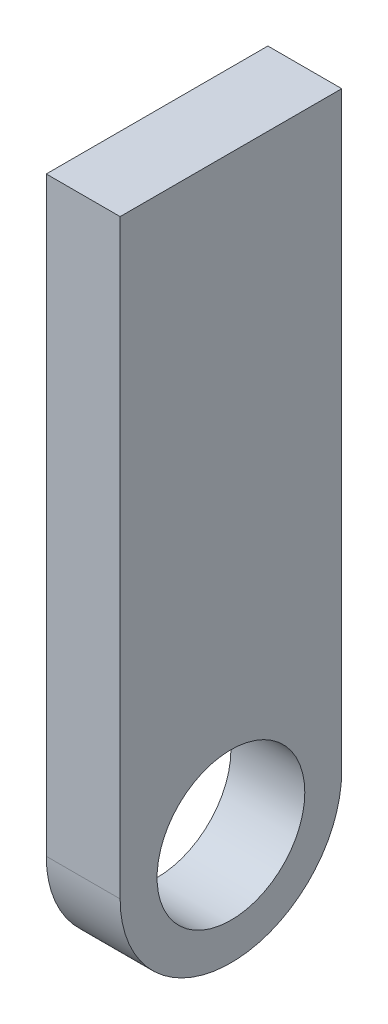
from build123d import *

# Parameters (mm, degrees)
SKETCH_1_R      = 10
EXTRUDE_1_DEPTH = 10


with BuildPart() as part:
    # Sketch 1 → Extrude 1 (new body)
    with BuildSketch(Plane(origin=(0, 0, 0), x_dir=(0, 0, -1), z_dir=(1, 0, 0))):
        with BuildLine():
            Line((-15, 0), (-15, 80))
            Line((-15, 80), (15, 80))
            Line((15, 80), (15, 0))
            ThreePointArc((15, 0), (0, -15), (-15, 0))
        make_face()
        Circle(SKETCH_1_R, mode=Mode.SUBTRACT)
    extrude(amount=EXTRUDE_1_DEPTH)


solid = part.part
